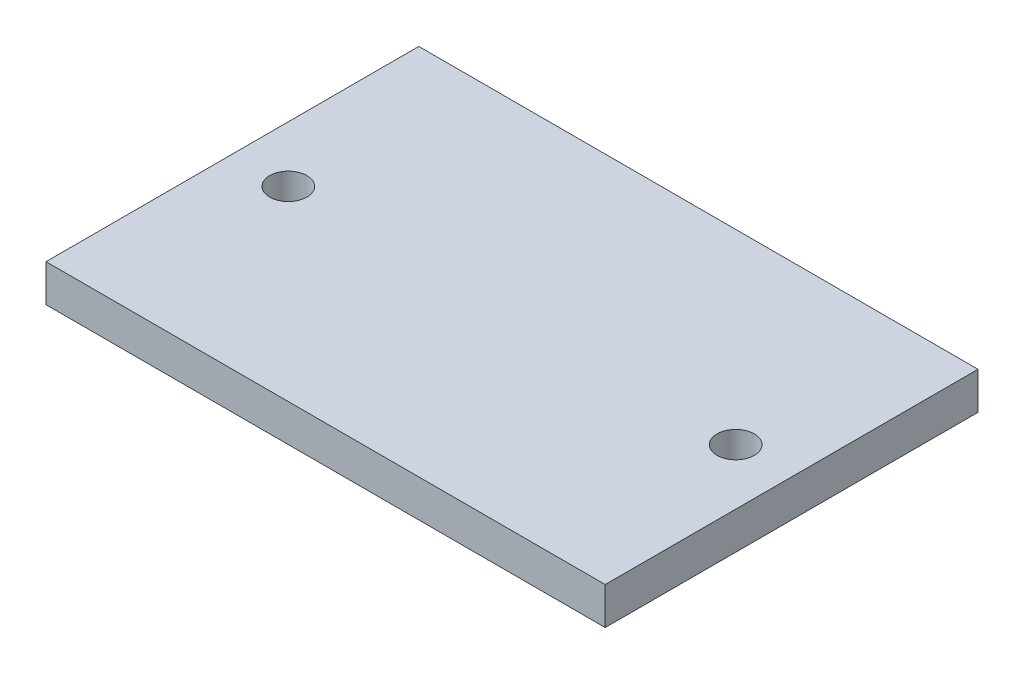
ISO-10303-21;
HEADER;
FILE_DESCRIPTION(('STEP AP214'),'2;1');
FILE_NAME('part.step','',(''),(''),'','','');
FILE_SCHEMA(('AUTOMOTIVE_DESIGN { 1 0 10303 214 1 1 1 1 }'));
ENDSEC;
DATA;
#1=APPLICATION_CONTEXT('core data for automotive mechanical design processes');
#2=APPLICATION_PROTOCOL_DEFINITION('international standard','automotive_design',2000,#1);
#3=PRODUCT_CONTEXT('',#1,'mechanical');
#4=PRODUCT('Part','Part','',(#3));
#5=PRODUCT_RELATED_PRODUCT_CATEGORY('part','',(#4));
#6=PRODUCT_DEFINITION_FORMATION('','',#4);
#7=PRODUCT_DEFINITION_CONTEXT('part definition',#1,'design');
#8=PRODUCT_DEFINITION('design','',#6,#7);
#9=PRODUCT_DEFINITION_SHAPE('','',#8);
#10=(LENGTH_UNIT() NAMED_UNIT(*) SI_UNIT(.MILLI.,.METRE.));
#11=(NAMED_UNIT(*) PLANE_ANGLE_UNIT() SI_UNIT($,.RADIAN.));
#12=(NAMED_UNIT(*) SI_UNIT($,.STERADIAN.) SOLID_ANGLE_UNIT());
#13=UNCERTAINTY_MEASURE_WITH_UNIT(LENGTH_MEASURE(1.E-05),#10,'distance_accuracy_value','');
#14=(GEOMETRIC_REPRESENTATION_CONTEXT(3) GLOBAL_UNCERTAINTY_ASSIGNED_CONTEXT((#13)) GLOBAL_UNIT_ASSIGNED_CONTEXT((#10,
#11,#12)) REPRESENTATION_CONTEXT('',''));
#15=CARTESIAN_POINT('',(0.,0.,0.));
#16=DIRECTION('',(0.,0.,1.));
#17=DIRECTION('',(1.,0.,0.));
#18=AXIS2_PLACEMENT_3D('',#15,#16,#17);
#19=CARTESIAN_POINT('',(-75.,10.,-50.));
#20=DIRECTION('',(1.,0.,0.));
#21=DIRECTION('',(0.,0.,-1.));
#22=AXIS2_PLACEMENT_3D('',#19,#20,#21);
#23=PLANE('',#22);
#24=DIRECTION('',(0.,0.,1.));
#25=VECTOR('',#24,1.);
#26=CARTESIAN_POINT('',(-75.,0.,-50.));
#27=LINE('',#26,#25);
#28=CARTESIAN_POINT('',(-75.,0.,-50.));
#29=VERTEX_POINT('',#28);
#30=CARTESIAN_POINT('',(-75.,0.,50.));
#31=VERTEX_POINT('',#30);
#32=EDGE_CURVE('E70',#29,#31,#27,.T.);
#33=ORIENTED_EDGE('',*,*,#32,.T.);
#34=DIRECTION('',(0.,-1.,0.));
#35=VECTOR('',#34,1.);
#36=CARTESIAN_POINT('',(-75.,10.,50.));
#37=LINE('',#36,#35);
#38=CARTESIAN_POINT('',(-75.,10.,50.));
#39=VERTEX_POINT('',#38);
#40=EDGE_CURVE('E11',#39,#31,#37,.T.);
#41=ORIENTED_EDGE('',*,*,#40,.F.);
#42=DIRECTION('',(0.,0.,1.));
#43=VECTOR('',#42,1.);
#44=CARTESIAN_POINT('',(-75.,10.,-50.));
#45=LINE('',#44,#43);
#46=CARTESIAN_POINT('',(-75.,10.,-50.));
#47=VERTEX_POINT('',#46);
#48=EDGE_CURVE('E93',#47,#39,#45,.T.);
#49=ORIENTED_EDGE('',*,*,#48,.F.);
#50=DIRECTION('',(0.,-1.,0.));
#51=VECTOR('',#50,1.);
#52=CARTESIAN_POINT('',(-75.,10.,-50.));
#53=LINE('',#52,#51);
#54=EDGE_CURVE('E82',#47,#29,#53,.T.);
#55=ORIENTED_EDGE('',*,*,#54,.T.);
#56=EDGE_LOOP('',(#33,#41,#49,#55));
#57=FACE_BOUND('',#56,.T.);
#58=ADVANCED_FACE('F26',(#57),#23,.F.);
#59=CARTESIAN_POINT('',(-75.,10.,50.));
#60=DIRECTION('',(0.,0.,-1.));
#61=DIRECTION('',(-1.,0.,0.));
#62=AXIS2_PLACEMENT_3D('',#59,#60,#61);
#63=PLANE('',#62);
#64=DIRECTION('',(1.,0.,0.));
#65=VECTOR('',#64,1.);
#66=CARTESIAN_POINT('',(-75.,0.,50.));
#67=LINE('',#66,#65);
#68=CARTESIAN_POINT('',(75.,0.,50.));
#69=VERTEX_POINT('',#68);
#70=EDGE_CURVE('E66',#31,#69,#67,.T.);
#71=ORIENTED_EDGE('',*,*,#70,.T.);
#72=DIRECTION('',(0.,-1.,0.));
#73=VECTOR('',#72,1.);
#74=CARTESIAN_POINT('',(75.,10.,50.));
#75=LINE('',#74,#73);
#76=CARTESIAN_POINT('',(75.,10.,50.));
#77=VERTEX_POINT('',#76);
#78=EDGE_CURVE('E33',#77,#69,#75,.T.);
#79=ORIENTED_EDGE('',*,*,#78,.F.);
#80=DIRECTION('',(1.,0.,0.));
#81=VECTOR('',#80,1.);
#82=CARTESIAN_POINT('',(-75.,10.,50.));
#83=LINE('',#82,#81);
#84=EDGE_CURVE('E78',#39,#77,#83,.T.);
#85=ORIENTED_EDGE('',*,*,#84,.F.);
#86=ORIENTED_EDGE('',*,*,#40,.T.);
#87=EDGE_LOOP('',(#71,#79,#85,#86));
#88=FACE_BOUND('',#87,.T.);
#89=ADVANCED_FACE('F77',(#88),#63,.F.);
#90=CARTESIAN_POINT('',(75.,10.,-50.));
#91=DIRECTION('',(-1.,0.,0.));
#92=DIRECTION('',(0.,0.,1.));
#93=AXIS2_PLACEMENT_3D('',#90,#91,#92);
#94=PLANE('',#93);
#95=DIRECTION('',(0.,0.,-1.));
#96=VECTOR('',#95,1.);
#97=CARTESIAN_POINT('',(75.,0.,-50.));
#98=LINE('',#97,#96);
#99=CARTESIAN_POINT('',(75.,0.,-50.));
#100=VERTEX_POINT('',#99);
#101=EDGE_CURVE('E71',#69,#100,#98,.T.);
#102=ORIENTED_EDGE('',*,*,#101,.T.);
#103=DIRECTION('',(0.,-1.,0.));
#104=VECTOR('',#103,1.);
#105=CARTESIAN_POINT('',(75.,10.,-50.));
#106=LINE('',#105,#104);
#107=CARTESIAN_POINT('',(75.,10.,-50.));
#108=VERTEX_POINT('',#107);
#109=EDGE_CURVE('E99',#108,#100,#106,.T.);
#110=ORIENTED_EDGE('',*,*,#109,.F.);
#111=DIRECTION('',(0.,0.,-1.));
#112=VECTOR('',#111,1.);
#113=CARTESIAN_POINT('',(75.,10.,-50.));
#114=LINE('',#113,#112);
#115=EDGE_CURVE('E45',#77,#108,#114,.T.);
#116=ORIENTED_EDGE('',*,*,#115,.F.);
#117=ORIENTED_EDGE('',*,*,#78,.T.);
#118=EDGE_LOOP('',(#102,#110,#116,#117));
#119=FACE_BOUND('',#118,.T.);
#120=ADVANCED_FACE('F102',(#119),#94,.F.);
#121=CARTESIAN_POINT('',(-75.,10.,-50.));
#122=DIRECTION('',(0.,0.,1.));
#123=DIRECTION('',(1.,0.,0.));
#124=AXIS2_PLACEMENT_3D('',#121,#122,#123);
#125=PLANE('',#124);
#126=DIRECTION('',(-1.,0.,0.));
#127=VECTOR('',#126,1.);
#128=CARTESIAN_POINT('',(-75.,0.,-50.));
#129=LINE('',#128,#127);
#130=EDGE_CURVE('E91',#100,#29,#129,.T.);
#131=ORIENTED_EDGE('',*,*,#130,.T.);
#132=ORIENTED_EDGE('',*,*,#54,.F.);
#133=DIRECTION('',(-1.,0.,0.));
#134=VECTOR('',#133,1.);
#135=CARTESIAN_POINT('',(-75.,10.,-50.));
#136=LINE('',#135,#134);
#137=EDGE_CURVE('E40',#108,#47,#136,.T.);
#138=ORIENTED_EDGE('',*,*,#137,.F.);
#139=ORIENTED_EDGE('',*,*,#109,.T.);
#140=EDGE_LOOP('',(#131,#132,#138,#139));
#141=FACE_BOUND('',#140,.T.);
#142=ADVANCED_FACE('F104',(#141),#125,.F.);
#143=CARTESIAN_POINT('',(-75.,10.,50.));
#144=DIRECTION('',(0.,1.,0.));
#145=DIRECTION('',(0.,0.,1.));
#146=AXIS2_PLACEMENT_3D('',#143,#144,#145);
#147=PLANE('',#146);
#148=CARTESIAN_POINT('',(60.,10.,0.));
#149=DIRECTION('',(0.,1.,0.));
#150=DIRECTION('',(0.,0.,1.));
#151=AXIS2_PLACEMENT_3D('',#148,#149,#150);
#152=CIRCLE('',#151,5.);
#153=CARTESIAN_POINT('',(60.,10.,5.));
#154=VERTEX_POINT('',#153);
#155=EDGE_CURVE('E159',#154,#154,#152,.T.);
#156=ORIENTED_EDGE('',*,*,#155,.F.);
#157=EDGE_LOOP('',(#156));
#158=FACE_BOUND('',#157,.T.);
#159=CARTESIAN_POINT('',(-60.,10.,0.));
#160=DIRECTION('',(0.,1.,0.));
#161=DIRECTION('',(0.,0.,1.));
#162=AXIS2_PLACEMENT_3D('',#159,#160,#161);
#163=CIRCLE('',#162,5.);
#164=CARTESIAN_POINT('',(-60.,10.,5.));
#165=VERTEX_POINT('',#164);
#166=EDGE_CURVE('E86',#165,#165,#163,.T.);
#167=ORIENTED_EDGE('',*,*,#166,.F.);
#168=EDGE_LOOP('',(#167));
#169=FACE_BOUND('',#168,.T.);
#170=ORIENTED_EDGE('',*,*,#48,.T.);
#171=ORIENTED_EDGE('',*,*,#84,.T.);
#172=ORIENTED_EDGE('',*,*,#115,.T.);
#173=ORIENTED_EDGE('',*,*,#137,.T.);
#174=EDGE_LOOP('',(#170,#171,#172,#173));
#175=FACE_BOUND('',#174,.T.);
#176=ADVANCED_FACE('F105',(#158,#169,#175),#147,.T.);
#177=CARTESIAN_POINT('',(-75.,0.,50.));
#178=DIRECTION('',(0.,1.,0.));
#179=DIRECTION('',(0.,0.,1.));
#180=AXIS2_PLACEMENT_3D('',#177,#178,#179);
#181=PLANE('',#180);
#182=CARTESIAN_POINT('',(60.,0.,0.));
#183=DIRECTION('',(0.,1.,0.));
#184=DIRECTION('',(0.,0.,1.));
#185=AXIS2_PLACEMENT_3D('',#182,#183,#184);
#186=CIRCLE('',#185,5.);
#187=CARTESIAN_POINT('',(60.,0.,5.));
#188=VERTEX_POINT('',#187);
#189=EDGE_CURVE('E157',#188,#188,#186,.T.);
#190=ORIENTED_EDGE('',*,*,#189,.T.);
#191=EDGE_LOOP('',(#190));
#192=FACE_BOUND('',#191,.T.);
#193=CARTESIAN_POINT('',(-60.,0.,0.));
#194=DIRECTION('',(0.,1.,0.));
#195=DIRECTION('',(0.,0.,1.));
#196=AXIS2_PLACEMENT_3D('',#193,#194,#195);
#197=CIRCLE('',#196,5.);
#198=CARTESIAN_POINT('',(-60.,0.,5.));
#199=VERTEX_POINT('',#198);
#200=EDGE_CURVE('E83',#199,#199,#197,.T.);
#201=ORIENTED_EDGE('',*,*,#200,.T.);
#202=EDGE_LOOP('',(#201));
#203=FACE_BOUND('',#202,.T.);
#204=ORIENTED_EDGE('',*,*,#32,.F.);
#205=ORIENTED_EDGE('',*,*,#130,.F.);
#206=ORIENTED_EDGE('',*,*,#101,.F.);
#207=ORIENTED_EDGE('',*,*,#70,.F.);
#208=EDGE_LOOP('',(#204,#205,#206,#207));
#209=FACE_BOUND('',#208,.T.);
#210=ADVANCED_FACE('F67',(#192,#203,#209),#181,.F.);
#211=CARTESIAN_POINT('',(-60.,0.,0.));
#212=DIRECTION('',(0.,1.,0.));
#213=DIRECTION('',(0.,0.,1.));
#214=AXIS2_PLACEMENT_3D('',#211,#212,#213);
#215=CYLINDRICAL_SURFACE('',#214,5.);
#216=ORIENTED_EDGE('',*,*,#200,.F.);
#217=EDGE_LOOP('',(#216));
#218=FACE_BOUND('',#217,.T.);
#219=ORIENTED_EDGE('',*,*,#166,.T.);
#220=EDGE_LOOP('',(#219));
#221=FACE_BOUND('',#220,.T.);
#222=ADVANCED_FACE('F113',(#218,#221),#215,.F.);
#223=CARTESIAN_POINT('',(60.,0.,0.));
#224=DIRECTION('',(0.,1.,0.));
#225=DIRECTION('',(0.,0.,1.));
#226=AXIS2_PLACEMENT_3D('',#223,#224,#225);
#227=CYLINDRICAL_SURFACE('',#226,5.);
#228=ORIENTED_EDGE('',*,*,#189,.F.);
#229=EDGE_LOOP('',(#228));
#230=FACE_BOUND('',#229,.T.);
#231=ORIENTED_EDGE('',*,*,#155,.T.);
#232=EDGE_LOOP('',(#231));
#233=FACE_BOUND('',#232,.T.);
#234=ADVANCED_FACE('F138',(#230,#233),#227,.F.);
#235=CLOSED_SHELL('',(#58,#89,#120,#142,#176,#210,#222,#234));
#236=MANIFOLD_SOLID_BREP('B2',#235);
#237=ADVANCED_BREP_SHAPE_REPRESENTATION('',(#18,#236),#14);
#238=SHAPE_DEFINITION_REPRESENTATION(#9,#237);
ENDSEC;
END-ISO-10303-21;
